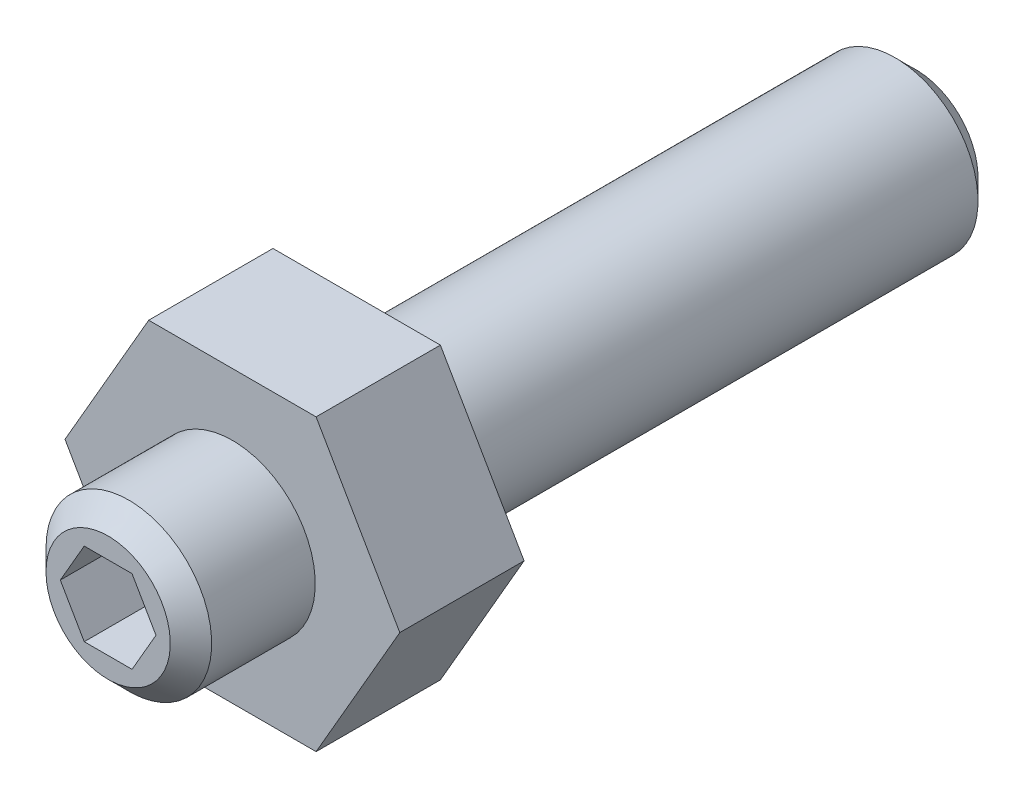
ISO-10303-21;
HEADER;
FILE_DESCRIPTION(('STEP AP214'),'2;1');
FILE_NAME('part.step','',(''),(''),'','','');
FILE_SCHEMA(('AUTOMOTIVE_DESIGN { 1 0 10303 214 1 1 1 1 }'));
ENDSEC;
DATA;
#1=APPLICATION_CONTEXT('core data for automotive mechanical design processes');
#2=APPLICATION_PROTOCOL_DEFINITION('international standard','automotive_design',2000,#1);
#3=PRODUCT_CONTEXT('',#1,'mechanical');
#4=PRODUCT('Part','Part','',(#3));
#5=PRODUCT_RELATED_PRODUCT_CATEGORY('part','',(#4));
#6=PRODUCT_DEFINITION_FORMATION('','',#4);
#7=PRODUCT_DEFINITION_CONTEXT('part definition',#1,'design');
#8=PRODUCT_DEFINITION('design','',#6,#7);
#9=PRODUCT_DEFINITION_SHAPE('','',#8);
#10=(LENGTH_UNIT() NAMED_UNIT(*) SI_UNIT(.MILLI.,.METRE.));
#11=(NAMED_UNIT(*) PLANE_ANGLE_UNIT() SI_UNIT($,.RADIAN.));
#12=(NAMED_UNIT(*) SI_UNIT($,.STERADIAN.) SOLID_ANGLE_UNIT());
#13=UNCERTAINTY_MEASURE_WITH_UNIT(LENGTH_MEASURE(1.E-05),#10,'distance_accuracy_value','');
#14=(GEOMETRIC_REPRESENTATION_CONTEXT(3) GLOBAL_UNCERTAINTY_ASSIGNED_CONTEXT((#13)) GLOBAL_UNIT_ASSIGNED_CONTEXT((#10,
#11,#12)) REPRESENTATION_CONTEXT('',''));
#15=CARTESIAN_POINT('',(0.,0.,0.));
#16=DIRECTION('',(0.,0.,1.));
#17=DIRECTION('',(1.,0.,0.));
#18=AXIS2_PLACEMENT_3D('',#15,#16,#17);
#19=CARTESIAN_POINT('',(0.,-6.99999999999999,3.));
#20=DIRECTION('',(0.,0.,-1.));
#21=DIRECTION('',(-1.,0.,0.));
#22=AXIS2_PLACEMENT_3D('',#19,#20,#21);
#23=PLANE('',#22);
#24=DIRECTION('',(0.5,0.866025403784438,0.));
#25=VECTOR('',#24,1.);
#26=CARTESIAN_POINT('',(2.02072594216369,-3.49999999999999,3.));
#27=LINE('',#26,#25);
#28=CARTESIAN_POINT('',(2.02072594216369,-3.49999999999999,3.));
#29=VERTEX_POINT('',#28);
#30=CARTESIAN_POINT('',(4.04145188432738,0.,3.));
#31=VERTEX_POINT('',#30);
#32=EDGE_CURVE('E197',#29,#31,#27,.T.);
#33=ORIENTED_EDGE('',*,*,#32,.T.);
#34=DIRECTION('',(-0.5,0.866025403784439,0.));
#35=VECTOR('',#34,1.);
#36=CARTESIAN_POINT('',(4.04145188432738,0.,3.));
#37=LINE('',#36,#35);
#38=CARTESIAN_POINT('',(2.02072594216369,3.5,3.));
#39=VERTEX_POINT('',#38);
#40=EDGE_CURVE('E199',#31,#39,#37,.T.);
#41=ORIENTED_EDGE('',*,*,#40,.T.);
#42=DIRECTION('',(-1.,0.,0.));
#43=VECTOR('',#42,1.);
#44=CARTESIAN_POINT('',(2.02072594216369,3.5,3.));
#45=LINE('',#44,#43);
#46=CARTESIAN_POINT('',(-2.02072594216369,3.5,3.));
#47=VERTEX_POINT('',#46);
#48=EDGE_CURVE('E201',#39,#47,#45,.T.);
#49=ORIENTED_EDGE('',*,*,#48,.T.);
#50=DIRECTION('',(-0.5,-0.866025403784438,0.));
#51=VECTOR('',#50,1.);
#52=CARTESIAN_POINT('',(-2.02072594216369,3.5,3.));
#53=LINE('',#52,#51);
#54=CARTESIAN_POINT('',(-4.04145188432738,0.,3.));
#55=VERTEX_POINT('',#54);
#56=EDGE_CURVE('E203',#47,#55,#53,.T.);
#57=ORIENTED_EDGE('',*,*,#56,.T.);
#58=DIRECTION('',(0.5,-0.866025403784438,0.));
#59=VECTOR('',#58,1.);
#60=CARTESIAN_POINT('',(-4.04145188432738,0.,3.));
#61=LINE('',#60,#59);
#62=CARTESIAN_POINT('',(-2.02072594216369,-3.5,3.));
#63=VERTEX_POINT('',#62);
#64=EDGE_CURVE('E205',#55,#63,#61,.T.);
#65=ORIENTED_EDGE('',*,*,#64,.T.);
#66=DIRECTION('',(1.,0.,0.));
#67=VECTOR('',#66,1.);
#68=CARTESIAN_POINT('',(-2.02072594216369,-3.5,3.));
#69=LINE('',#68,#67);
#70=EDGE_CURVE('E54',#63,#29,#69,.T.);
#71=ORIENTED_EDGE('',*,*,#70,.T.);
#72=EDGE_LOOP('',(#33,#41,#49,#57,#65,#71));
#73=FACE_BOUND('',#72,.T.);
#74=CARTESIAN_POINT('',(0.,0.,3.));
#75=DIRECTION('',(0.,0.,-1.));
#76=DIRECTION('',(-1.,0.,0.));
#77=AXIS2_PLACEMENT_3D('',#74,#75,#76);
#78=CIRCLE('',#77,2.);
#79=CARTESIAN_POINT('',(-2.,0.,3.));
#80=VERTEX_POINT('',#79);
#81=EDGE_CURVE('E179',#80,#80,#78,.F.);
#82=ORIENTED_EDGE('',*,*,#81,.F.);
#83=EDGE_LOOP('',(#82));
#84=FACE_BOUND('',#83,.T.);
#85=ADVANCED_FACE('F31',(#73,#84),#23,.F.);
#86=CARTESIAN_POINT('',(0.,-6.99999999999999,0.));
#87=DIRECTION('',(0.,0.,-1.));
#88=DIRECTION('',(-1.,0.,0.));
#89=AXIS2_PLACEMENT_3D('',#86,#87,#88);
#90=PLANE('',#89);
#91=DIRECTION('',(0.5,0.866025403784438,0.));
#92=VECTOR('',#91,1.);
#93=CARTESIAN_POINT('',(2.02072594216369,-3.49999999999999,0.));
#94=LINE('',#93,#92);
#95=CARTESIAN_POINT('',(2.02072594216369,-3.49999999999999,0.));
#96=VERTEX_POINT('',#95);
#97=CARTESIAN_POINT('',(4.04145188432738,0.,0.));
#98=VERTEX_POINT('',#97);
#99=EDGE_CURVE('E184',#96,#98,#94,.T.);
#100=ORIENTED_EDGE('',*,*,#99,.F.);
#101=DIRECTION('',(1.,0.,0.));
#102=VECTOR('',#101,1.);
#103=CARTESIAN_POINT('',(-2.02072594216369,-3.5,0.));
#104=LINE('',#103,#102);
#105=CARTESIAN_POINT('',(-2.02072594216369,-3.5,0.));
#106=VERTEX_POINT('',#105);
#107=EDGE_CURVE('E195',#106,#96,#104,.T.);
#108=ORIENTED_EDGE('',*,*,#107,.F.);
#109=DIRECTION('',(0.5,-0.866025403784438,0.));
#110=VECTOR('',#109,1.);
#111=CARTESIAN_POINT('',(-4.04145188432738,0.,0.));
#112=LINE('',#111,#110);
#113=CARTESIAN_POINT('',(-4.04145188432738,0.,0.));
#114=VERTEX_POINT('',#113);
#115=EDGE_CURVE('E193',#114,#106,#112,.T.);
#116=ORIENTED_EDGE('',*,*,#115,.F.);
#117=DIRECTION('',(-0.5,-0.866025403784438,0.));
#118=VECTOR('',#117,1.);
#119=CARTESIAN_POINT('',(-2.02072594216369,3.5,0.));
#120=LINE('',#119,#118);
#121=CARTESIAN_POINT('',(-2.02072594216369,3.5,0.));
#122=VERTEX_POINT('',#121);
#123=EDGE_CURVE('E191',#122,#114,#120,.T.);
#124=ORIENTED_EDGE('',*,*,#123,.F.);
#125=DIRECTION('',(-1.,0.,0.));
#126=VECTOR('',#125,1.);
#127=CARTESIAN_POINT('',(2.02072594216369,3.5,0.));
#128=LINE('',#127,#126);
#129=CARTESIAN_POINT('',(2.02072594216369,3.5,0.));
#130=VERTEX_POINT('',#129);
#131=EDGE_CURVE('E189',#130,#122,#128,.T.);
#132=ORIENTED_EDGE('',*,*,#131,.F.);
#133=DIRECTION('',(-0.5,0.866025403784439,0.));
#134=VECTOR('',#133,1.);
#135=CARTESIAN_POINT('',(4.04145188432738,0.,0.));
#136=LINE('',#135,#134);
#137=EDGE_CURVE('E187',#98,#130,#136,.T.);
#138=ORIENTED_EDGE('',*,*,#137,.F.);
#139=EDGE_LOOP('',(#100,#108,#116,#124,#132,#138));
#140=FACE_BOUND('',#139,.T.);
#141=CARTESIAN_POINT('',(0.,0.,0.));
#142=DIRECTION('',(0.,0.,-1.));
#143=DIRECTION('',(-1.,0.,0.));
#144=AXIS2_PLACEMENT_3D('',#141,#142,#143);
#145=CIRCLE('',#144,2.);
#146=CARTESIAN_POINT('',(-2.,0.,0.));
#147=VERTEX_POINT('',#146);
#148=EDGE_CURVE('E172',#147,#147,#145,.F.);
#149=ORIENTED_EDGE('',*,*,#148,.T.);
#150=EDGE_LOOP('',(#149));
#151=FACE_BOUND('',#150,.T.);
#152=ADVANCED_FACE('F253',(#140,#151),#90,.T.);
#153=CARTESIAN_POINT('',(2.02072594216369,-3.49999999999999,3.));
#154=DIRECTION('',(-0.866025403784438,0.5,0.));
#155=DIRECTION('',(-0.5,-0.866025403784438,0.));
#156=AXIS2_PLACEMENT_3D('',#153,#154,#155);
#157=PLANE('',#156);
#158=ORIENTED_EDGE('',*,*,#99,.T.);
#159=DIRECTION('',(0.,0.,-1.));
#160=VECTOR('',#159,1.);
#161=CARTESIAN_POINT('',(4.04145188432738,0.,3.));
#162=LINE('',#161,#160);
#163=EDGE_CURVE('E183',#31,#98,#162,.T.);
#164=ORIENTED_EDGE('',*,*,#163,.F.);
#165=ORIENTED_EDGE('',*,*,#32,.F.);
#166=DIRECTION('',(0.,0.,-1.));
#167=VECTOR('',#166,1.);
#168=CARTESIAN_POINT('',(2.02072594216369,-3.49999999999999,3.));
#169=LINE('',#168,#167);
#170=EDGE_CURVE('E208',#29,#96,#169,.T.);
#171=ORIENTED_EDGE('',*,*,#170,.T.);
#172=EDGE_LOOP('',(#158,#164,#165,#171));
#173=FACE_BOUND('',#172,.T.);
#174=ADVANCED_FACE('F33',(#173),#157,.F.);
#175=CARTESIAN_POINT('',(4.04145188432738,0.,3.));
#176=DIRECTION('',(-0.866025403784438,-0.5,0.));
#177=DIRECTION('',(0.5,-0.866025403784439,0.));
#178=AXIS2_PLACEMENT_3D('',#175,#176,#177);
#179=PLANE('',#178);
#180=ORIENTED_EDGE('',*,*,#137,.T.);
#181=DIRECTION('',(0.,0.,-1.));
#182=VECTOR('',#181,1.);
#183=CARTESIAN_POINT('',(2.02072594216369,3.5,3.));
#184=LINE('',#183,#182);
#185=EDGE_CURVE('E220',#39,#130,#184,.T.);
#186=ORIENTED_EDGE('',*,*,#185,.F.);
#187=ORIENTED_EDGE('',*,*,#40,.F.);
#188=ORIENTED_EDGE('',*,*,#163,.T.);
#189=EDGE_LOOP('',(#180,#186,#187,#188));
#190=FACE_BOUND('',#189,.T.);
#191=ADVANCED_FACE('F278',(#190),#179,.F.);
#192=CARTESIAN_POINT('',(2.02072594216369,3.5,3.));
#193=DIRECTION('',(0.,-1.,0.));
#194=DIRECTION('',(0.,0.,-1.));
#195=AXIS2_PLACEMENT_3D('',#192,#193,#194);
#196=PLANE('',#195);
#197=ORIENTED_EDGE('',*,*,#131,.T.);
#198=DIRECTION('',(0.,0.,-1.));
#199=VECTOR('',#198,1.);
#200=CARTESIAN_POINT('',(-2.02072594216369,3.5,3.));
#201=LINE('',#200,#199);
#202=EDGE_CURVE('E217',#47,#122,#201,.T.);
#203=ORIENTED_EDGE('',*,*,#202,.F.);
#204=ORIENTED_EDGE('',*,*,#48,.F.);
#205=ORIENTED_EDGE('',*,*,#185,.T.);
#206=EDGE_LOOP('',(#197,#203,#204,#205));
#207=FACE_BOUND('',#206,.T.);
#208=ADVANCED_FACE('F275',(#207),#196,.F.);
#209=CARTESIAN_POINT('',(-2.02072594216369,3.5,3.));
#210=DIRECTION('',(0.866025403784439,-0.5,0.));
#211=DIRECTION('',(0.5,0.866025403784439,0.));
#212=AXIS2_PLACEMENT_3D('',#209,#210,#211);
#213=PLANE('',#212);
#214=ORIENTED_EDGE('',*,*,#123,.T.);
#215=DIRECTION('',(0.,0.,-1.));
#216=VECTOR('',#215,1.);
#217=CARTESIAN_POINT('',(-4.04145188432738,0.,3.));
#218=LINE('',#217,#216);
#219=EDGE_CURVE('E214',#55,#114,#218,.T.);
#220=ORIENTED_EDGE('',*,*,#219,.F.);
#221=ORIENTED_EDGE('',*,*,#56,.F.);
#222=ORIENTED_EDGE('',*,*,#202,.T.);
#223=EDGE_LOOP('',(#214,#220,#221,#222));
#224=FACE_BOUND('',#223,.T.);
#225=ADVANCED_FACE('F271',(#224),#213,.F.);
#226=CARTESIAN_POINT('',(-4.04145188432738,0.,3.));
#227=DIRECTION('',(0.866025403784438,0.5,0.));
#228=DIRECTION('',(-0.5,0.866025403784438,0.));
#229=AXIS2_PLACEMENT_3D('',#226,#227,#228);
#230=PLANE('',#229);
#231=ORIENTED_EDGE('',*,*,#115,.T.);
#232=DIRECTION('',(0.,0.,-1.));
#233=VECTOR('',#232,1.);
#234=CARTESIAN_POINT('',(-2.02072594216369,-3.5,3.));
#235=LINE('',#234,#233);
#236=EDGE_CURVE('E211',#63,#106,#235,.T.);
#237=ORIENTED_EDGE('',*,*,#236,.F.);
#238=ORIENTED_EDGE('',*,*,#64,.F.);
#239=ORIENTED_EDGE('',*,*,#219,.T.);
#240=EDGE_LOOP('',(#231,#237,#238,#239));
#241=FACE_BOUND('',#240,.T.);
#242=ADVANCED_FACE('F267',(#241),#230,.F.);
#243=CARTESIAN_POINT('',(-2.02072594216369,-3.5,3.));
#244=DIRECTION('',(0.,1.,0.));
#245=DIRECTION('',(-1.,0.,0.));
#246=AXIS2_PLACEMENT_3D('',#243,#244,#245);
#247=PLANE('',#246);
#248=ORIENTED_EDGE('',*,*,#107,.T.);
#249=ORIENTED_EDGE('',*,*,#170,.F.);
#250=ORIENTED_EDGE('',*,*,#70,.F.);
#251=ORIENTED_EDGE('',*,*,#236,.T.);
#252=EDGE_LOOP('',(#248,#249,#250,#251));
#253=FACE_BOUND('',#252,.T.);
#254=ADVANCED_FACE('F263',(#253),#247,.F.);
#255=CARTESIAN_POINT('',(0.,0.,-13.5));
#256=DIRECTION('',(0.,0.,-1.));
#257=DIRECTION('',(-1.,0.,0.));
#258=AXIS2_PLACEMENT_3D('',#255,#256,#257);
#259=PLANE('',#258);
#260=CARTESIAN_POINT('',(0.,0.,-13.5));
#261=DIRECTION('',(0.,0.,-1.));
#262=DIRECTION('',(-1.,0.,0.));
#263=AXIS2_PLACEMENT_3D('',#260,#261,#262);
#264=CIRCLE('',#263,1.5);
#265=CARTESIAN_POINT('',(-1.5,0.,-13.5));
#266=VERTEX_POINT('',#265);
#267=EDGE_CURVE('E182',#266,#266,#264,.T.);
#268=ORIENTED_EDGE('',*,*,#267,.T.);
#269=EDGE_LOOP('',(#268));
#270=FACE_BOUND('',#269,.T.);
#271=ADVANCED_FACE('F266',(#270),#259,.T.);
#272=CARTESIAN_POINT('',(0.,0.,-13.5));
#273=DIRECTION('',(0.,0.,1.));
#274=DIRECTION('',(1.,0.,0.));
#275=AXIS2_PLACEMENT_3D('',#272,#273,#274);
#276=CYLINDRICAL_SURFACE('',#275,2.);
#277=CARTESIAN_POINT('',(0.,0.,-13.));
#278=DIRECTION('',(0.,0.,-1.));
#279=DIRECTION('',(-1.,0.,0.));
#280=AXIS2_PLACEMENT_3D('',#277,#278,#279);
#281=CIRCLE('',#280,2.);
#282=CARTESIAN_POINT('',(-2.,0.,-13.));
#283=VERTEX_POINT('',#282);
#284=EDGE_CURVE('E229',#283,#283,#281,.F.);
#285=ORIENTED_EDGE('',*,*,#284,.T.);
#286=EDGE_LOOP('',(#285));
#287=FACE_BOUND('',#286,.T.);
#288=ORIENTED_EDGE('',*,*,#148,.F.);
#289=EDGE_LOOP('',(#288));
#290=FACE_BOUND('',#289,.T.);
#291=ADVANCED_FACE('F303',(#287,#290),#276,.T.);
#292=CARTESIAN_POINT('',(0.,0.,5.5));
#293=DIRECTION('',(0.,0.,-1.));
#294=DIRECTION('',(-1.,0.,0.));
#295=AXIS2_PLACEMENT_3D('',#292,#293,#294);
#296=CIRCLE('',#295,2.);
#297=CARTESIAN_POINT('',(-2.,0.,5.5));
#298=VERTEX_POINT('',#297);
#299=EDGE_CURVE('E39',#298,#298,#296,.T.);
#300=ORIENTED_EDGE('',*,*,#299,.T.);
#301=EDGE_LOOP('',(#300));
#302=FACE_BOUND('',#301,.T.);
#303=ORIENTED_EDGE('',*,*,#81,.T.);
#304=EDGE_LOOP('',(#303));
#305=FACE_BOUND('',#304,.T.);
#306=ADVANCED_FACE('F234',(#302,#305),#276,.T.);
#307=CARTESIAN_POINT('',(0.,0.,6.));
#308=DIRECTION('',(0.,0.,-1.));
#309=DIRECTION('',(-1.,0.,0.));
#310=AXIS2_PLACEMENT_3D('',#307,#308,#309);
#311=PLANE('',#310);
#312=DIRECTION('',(-0.5,0.866025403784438,0.));
#313=VECTOR('',#312,1.);
#314=CARTESIAN_POINT('',(1.15470053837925,0.,6.));
#315=LINE('',#314,#313);
#316=CARTESIAN_POINT('',(1.15470053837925,0.,6.));
#317=VERTEX_POINT('',#316);
#318=CARTESIAN_POINT('',(0.577350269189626,1.,6.));
#319=VERTEX_POINT('',#318);
#320=EDGE_CURVE('E136',#317,#319,#315,.T.);
#321=ORIENTED_EDGE('',*,*,#320,.F.);
#322=DIRECTION('',(0.5,0.866025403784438,0.));
#323=VECTOR('',#322,1.);
#324=CARTESIAN_POINT('',(0.577350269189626,-1.,6.));
#325=LINE('',#324,#323);
#326=CARTESIAN_POINT('',(0.577350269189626,-1.,6.));
#327=VERTEX_POINT('',#326);
#328=EDGE_CURVE('E46',#327,#317,#325,.T.);
#329=ORIENTED_EDGE('',*,*,#328,.F.);
#330=DIRECTION('',(1.,0.,0.));
#331=VECTOR('',#330,1.);
#332=CARTESIAN_POINT('',(-0.577350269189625,-1.,6.));
#333=LINE('',#332,#331);
#334=CARTESIAN_POINT('',(-0.577350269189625,-1.,6.));
#335=VERTEX_POINT('',#334);
#336=EDGE_CURVE('E152',#335,#327,#333,.T.);
#337=ORIENTED_EDGE('',*,*,#336,.F.);
#338=DIRECTION('',(0.5,-0.866025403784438,0.));
#339=VECTOR('',#338,1.);
#340=CARTESIAN_POINT('',(-1.15470053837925,0.,6.));
#341=LINE('',#340,#339);
#342=CARTESIAN_POINT('',(-1.15470053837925,0.,6.));
#343=VERTEX_POINT('',#342);
#344=EDGE_CURVE('E146',#343,#335,#341,.T.);
#345=ORIENTED_EDGE('',*,*,#344,.F.);
#346=DIRECTION('',(-0.5,-0.866025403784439,0.));
#347=VECTOR('',#346,1.);
#348=CARTESIAN_POINT('',(-0.577350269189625,1.,6.));
#349=LINE('',#348,#347);
#350=CARTESIAN_POINT('',(-0.577350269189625,1.,6.));
#351=VERTEX_POINT('',#350);
#352=EDGE_CURVE('E144',#351,#343,#349,.T.);
#353=ORIENTED_EDGE('',*,*,#352,.F.);
#354=DIRECTION('',(-1.,0.,0.));
#355=VECTOR('',#354,1.);
#356=CARTESIAN_POINT('',(0.577350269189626,1.,6.));
#357=LINE('',#356,#355);
#358=EDGE_CURVE('E125',#319,#351,#357,.T.);
#359=ORIENTED_EDGE('',*,*,#358,.F.);
#360=EDGE_LOOP('',(#321,#329,#337,#345,#353,#359));
#361=FACE_BOUND('',#360,.T.);
#362=CARTESIAN_POINT('',(0.,0.,6.));
#363=DIRECTION('',(0.,0.,-1.));
#364=DIRECTION('',(-1.,0.,0.));
#365=AXIS2_PLACEMENT_3D('',#362,#363,#364);
#366=CIRCLE('',#365,1.5);
#367=CARTESIAN_POINT('',(-1.5,0.,6.));
#368=VERTEX_POINT('',#367);
#369=EDGE_CURVE('E11',#368,#368,#366,.F.);
#370=ORIENTED_EDGE('',*,*,#369,.T.);
#371=EDGE_LOOP('',(#370));
#372=FACE_BOUND('',#371,.T.);
#373=ADVANCED_FACE('F140',(#361,#372),#311,.F.);
#374=CARTESIAN_POINT('',(0.,0.,-13.5));
#375=DIRECTION('',(0.,0.,1.));
#376=DIRECTION('',(1.,0.,0.));
#377=AXIS2_PLACEMENT_3D('',#374,#375,#376);
#378=CONICAL_SURFACE('',#377,1.5,0.785398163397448);
#379=ORIENTED_EDGE('',*,*,#284,.F.);
#380=EDGE_LOOP('',(#379));
#381=FACE_BOUND('',#380,.T.);
#382=ORIENTED_EDGE('',*,*,#267,.F.);
#383=EDGE_LOOP('',(#382));
#384=FACE_BOUND('',#383,.T.);
#385=ADVANCED_FACE('F240',(#381,#384),#378,.T.);
#386=CARTESIAN_POINT('',(0.,0.,5.5));
#387=DIRECTION('',(0.,0.,-1.));
#388=DIRECTION('',(-1.,0.,0.));
#389=AXIS2_PLACEMENT_3D('',#386,#387,#388);
#390=CONICAL_SURFACE('',#389,2.,0.78539816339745);
#391=ORIENTED_EDGE('',*,*,#369,.F.);
#392=EDGE_LOOP('',(#391));
#393=FACE_BOUND('',#392,.T.);
#394=ORIENTED_EDGE('',*,*,#299,.F.);
#395=EDGE_LOOP('',(#394));
#396=FACE_BOUND('',#395,.T.);
#397=ADVANCED_FACE('F237',(#393,#396),#390,.T.);
#398=CARTESIAN_POINT('',(0.577350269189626,-1.,2.));
#399=DIRECTION('',(0.866025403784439,-0.5,0.));
#400=DIRECTION('',(0.5,0.866025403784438,0.));
#401=AXIS2_PLACEMENT_3D('',#398,#399,#400);
#402=PLANE('',#401);
#403=ORIENTED_EDGE('',*,*,#328,.T.);
#404=DIRECTION('',(0.,0.,1.));
#405=VECTOR('',#404,1.);
#406=CARTESIAN_POINT('',(1.15470053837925,0.,2.));
#407=LINE('',#406,#405);
#408=CARTESIAN_POINT('',(1.15470053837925,0.,2.));
#409=VERTEX_POINT('',#408);
#410=EDGE_CURVE('E133',#409,#317,#407,.T.);
#411=ORIENTED_EDGE('',*,*,#410,.F.);
#412=DIRECTION('',(0.5,0.866025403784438,0.));
#413=VECTOR('',#412,1.);
#414=CARTESIAN_POINT('',(0.577350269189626,-1.,2.));
#415=LINE('',#414,#413);
#416=CARTESIAN_POINT('',(0.577350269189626,-1.,2.));
#417=VERTEX_POINT('',#416);
#418=EDGE_CURVE('E155',#417,#409,#415,.T.);
#419=ORIENTED_EDGE('',*,*,#418,.F.);
#420=DIRECTION('',(0.,0.,1.));
#421=VECTOR('',#420,1.);
#422=CARTESIAN_POINT('',(0.577350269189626,-1.,2.));
#423=LINE('',#422,#421);
#424=EDGE_CURVE('E170',#417,#327,#423,.T.);
#425=ORIENTED_EDGE('',*,*,#424,.T.);
#426=EDGE_LOOP('',(#403,#411,#419,#425));
#427=FACE_BOUND('',#426,.T.);
#428=ADVANCED_FACE('F239',(#427),#402,.F.);
#429=CARTESIAN_POINT('',(-0.577350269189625,-1.,2.));
#430=DIRECTION('',(0.,-1.,0.));
#431=DIRECTION('',(0.,0.,-1.));
#432=AXIS2_PLACEMENT_3D('',#429,#430,#431);
#433=PLANE('',#432);
#434=ORIENTED_EDGE('',*,*,#336,.T.);
#435=ORIENTED_EDGE('',*,*,#424,.F.);
#436=DIRECTION('',(1.,0.,0.));
#437=VECTOR('',#436,1.);
#438=CARTESIAN_POINT('',(-0.577350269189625,-1.,2.));
#439=LINE('',#438,#437);
#440=CARTESIAN_POINT('',(-0.577350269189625,-1.,2.));
#441=VERTEX_POINT('',#440);
#442=EDGE_CURVE('E167',#441,#417,#439,.T.);
#443=ORIENTED_EDGE('',*,*,#442,.F.);
#444=DIRECTION('',(0.,0.,1.));
#445=VECTOR('',#444,1.);
#446=CARTESIAN_POINT('',(-0.577350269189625,-1.,2.));
#447=LINE('',#446,#445);
#448=EDGE_CURVE('E173',#441,#335,#447,.T.);
#449=ORIENTED_EDGE('',*,*,#448,.T.);
#450=EDGE_LOOP('',(#434,#435,#443,#449));
#451=FACE_BOUND('',#450,.T.);
#452=ADVANCED_FACE('F247',(#451),#433,.F.);
#453=CARTESIAN_POINT('',(-1.15470053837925,0.,2.));
#454=DIRECTION('',(-0.866025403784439,-0.5,0.));
#455=DIRECTION('',(0.5,-0.866025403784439,0.));
#456=AXIS2_PLACEMENT_3D('',#453,#454,#455);
#457=PLANE('',#456);
#458=ORIENTED_EDGE('',*,*,#344,.T.);
#459=ORIENTED_EDGE('',*,*,#448,.F.);
#460=DIRECTION('',(0.5,-0.866025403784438,0.));
#461=VECTOR('',#460,1.);
#462=CARTESIAN_POINT('',(-1.15470053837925,0.,2.));
#463=LINE('',#462,#461);
#464=CARTESIAN_POINT('',(-1.15470053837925,0.,2.));
#465=VERTEX_POINT('',#464);
#466=EDGE_CURVE('E164',#465,#441,#463,.T.);
#467=ORIENTED_EDGE('',*,*,#466,.F.);
#468=DIRECTION('',(0.,0.,1.));
#469=VECTOR('',#468,1.);
#470=CARTESIAN_POINT('',(-1.15470053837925,0.,2.));
#471=LINE('',#470,#469);
#472=EDGE_CURVE('E175',#465,#343,#471,.T.);
#473=ORIENTED_EDGE('',*,*,#472,.T.);
#474=EDGE_LOOP('',(#458,#459,#467,#473));
#475=FACE_BOUND('',#474,.T.);
#476=ADVANCED_FACE('F343',(#475),#457,.F.);
#477=CARTESIAN_POINT('',(-0.577350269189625,1.,2.));
#478=DIRECTION('',(-0.866025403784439,0.5,0.));
#479=DIRECTION('',(-0.5,-0.866025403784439,0.));
#480=AXIS2_PLACEMENT_3D('',#477,#478,#479);
#481=PLANE('',#480);
#482=ORIENTED_EDGE('',*,*,#352,.T.);
#483=ORIENTED_EDGE('',*,*,#472,.F.);
#484=DIRECTION('',(-0.5,-0.866025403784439,0.));
#485=VECTOR('',#484,1.);
#486=CARTESIAN_POINT('',(-0.577350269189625,1.,2.));
#487=LINE('',#486,#485);
#488=CARTESIAN_POINT('',(-0.577350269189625,1.,2.));
#489=VERTEX_POINT('',#488);
#490=EDGE_CURVE('E161',#489,#465,#487,.T.);
#491=ORIENTED_EDGE('',*,*,#490,.F.);
#492=DIRECTION('',(0.,0.,1.));
#493=VECTOR('',#492,1.);
#494=CARTESIAN_POINT('',(-0.577350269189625,1.,2.));
#495=LINE('',#494,#493);
#496=EDGE_CURVE('E132',#489,#351,#495,.T.);
#497=ORIENTED_EDGE('',*,*,#496,.T.);
#498=EDGE_LOOP('',(#482,#483,#491,#497));
#499=FACE_BOUND('',#498,.T.);
#500=ADVANCED_FACE('F352',(#499),#481,.F.);
#501=CARTESIAN_POINT('',(0.577350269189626,1.,2.));
#502=DIRECTION('',(0.,1.,0.));
#503=DIRECTION('',(0.,0.,1.));
#504=AXIS2_PLACEMENT_3D('',#501,#502,#503);
#505=PLANE('',#504);
#506=ORIENTED_EDGE('',*,*,#358,.T.);
#507=ORIENTED_EDGE('',*,*,#496,.F.);
#508=DIRECTION('',(-1.,0.,0.));
#509=VECTOR('',#508,1.);
#510=CARTESIAN_POINT('',(0.577350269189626,1.,2.));
#511=LINE('',#510,#509);
#512=CARTESIAN_POINT('',(0.577350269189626,1.,2.));
#513=VERTEX_POINT('',#512);
#514=EDGE_CURVE('E128',#513,#489,#511,.T.);
#515=ORIENTED_EDGE('',*,*,#514,.F.);
#516=DIRECTION('',(0.,0.,1.));
#517=VECTOR('',#516,1.);
#518=CARTESIAN_POINT('',(0.577350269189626,1.,2.));
#519=LINE('',#518,#517);
#520=EDGE_CURVE('E121',#513,#319,#519,.T.);
#521=ORIENTED_EDGE('',*,*,#520,.T.);
#522=EDGE_LOOP('',(#506,#507,#515,#521));
#523=FACE_BOUND('',#522,.T.);
#524=ADVANCED_FACE('F123',(#523),#505,.F.);
#525=CARTESIAN_POINT('',(1.15470053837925,0.,2.));
#526=DIRECTION('',(0.866025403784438,0.5,0.));
#527=DIRECTION('',(-0.5,0.866025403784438,0.));
#528=AXIS2_PLACEMENT_3D('',#525,#526,#527);
#529=PLANE('',#528);
#530=ORIENTED_EDGE('',*,*,#320,.T.);
#531=ORIENTED_EDGE('',*,*,#520,.F.);
#532=DIRECTION('',(-0.5,0.866025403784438,0.));
#533=VECTOR('',#532,1.);
#534=CARTESIAN_POINT('',(1.15470053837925,0.,2.));
#535=LINE('',#534,#533);
#536=EDGE_CURVE('E158',#409,#513,#535,.T.);
#537=ORIENTED_EDGE('',*,*,#536,.F.);
#538=ORIENTED_EDGE('',*,*,#410,.T.);
#539=EDGE_LOOP('',(#530,#531,#537,#538));
#540=FACE_BOUND('',#539,.T.);
#541=ADVANCED_FACE('F137',(#540),#529,.F.);
#542=CARTESIAN_POINT('',(1.15470053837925,0.,2.));
#543=DIRECTION('',(0.,0.,1.));
#544=DIRECTION('',(1.,0.,0.));
#545=AXIS2_PLACEMENT_3D('',#542,#543,#544);
#546=PLANE('',#545);
#547=ORIENTED_EDGE('',*,*,#418,.T.);
#548=ORIENTED_EDGE('',*,*,#536,.T.);
#549=ORIENTED_EDGE('',*,*,#514,.T.);
#550=ORIENTED_EDGE('',*,*,#490,.T.);
#551=ORIENTED_EDGE('',*,*,#466,.T.);
#552=ORIENTED_EDGE('',*,*,#442,.T.);
#553=EDGE_LOOP('',(#547,#548,#549,#550,#551,#552));
#554=FACE_BOUND('',#553,.T.);
#555=ADVANCED_FACE('F376',(#554),#546,.T.);
#556=CLOSED_SHELL('',(#85,#152,#174,#191,#208,#225,#242,#254,#271,#291,#306,#373,#385,#397,#428,
#452,#476,#500,#524,#541,#555));
#557=MANIFOLD_SOLID_BREP('B2',#556);
#558=ADVANCED_BREP_SHAPE_REPRESENTATION('',(#18,#557),#14);
#559=SHAPE_DEFINITION_REPRESENTATION(#9,#558);
ENDSEC;
END-ISO-10303-21;
